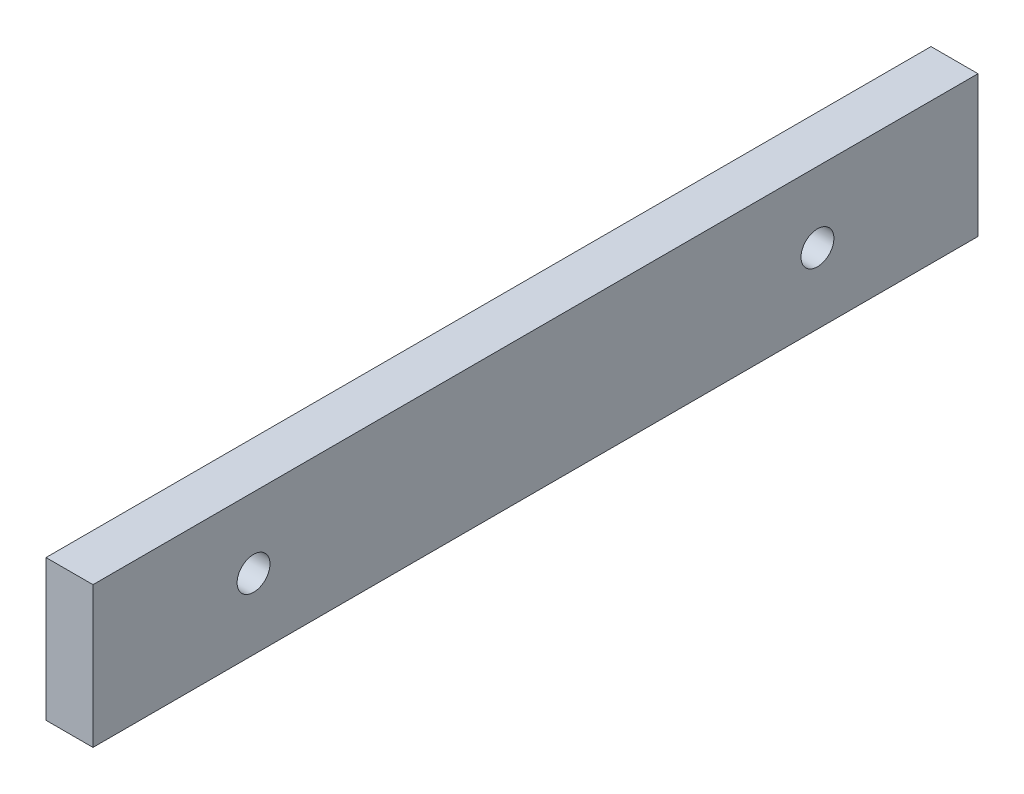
ISO-10303-21;
HEADER;
FILE_DESCRIPTION(('STEP AP214'),'2;1');
FILE_NAME('part.step','',(''),(''),'','','');
FILE_SCHEMA(('AUTOMOTIVE_DESIGN { 1 0 10303 214 1 1 1 1 }'));
ENDSEC;
DATA;
#1=APPLICATION_CONTEXT('core data for automotive mechanical design processes');
#2=APPLICATION_PROTOCOL_DEFINITION('international standard','automotive_design',2000,#1);
#3=PRODUCT_CONTEXT('',#1,'mechanical');
#4=PRODUCT('Part','Part','',(#3));
#5=PRODUCT_RELATED_PRODUCT_CATEGORY('part','',(#4));
#6=PRODUCT_DEFINITION_FORMATION('','',#4);
#7=PRODUCT_DEFINITION_CONTEXT('part definition',#1,'design');
#8=PRODUCT_DEFINITION('design','',#6,#7);
#9=PRODUCT_DEFINITION_SHAPE('','',#8);
#10=(LENGTH_UNIT() NAMED_UNIT(*) SI_UNIT(.MILLI.,.METRE.));
#11=(NAMED_UNIT(*) PLANE_ANGLE_UNIT() SI_UNIT($,.RADIAN.));
#12=(NAMED_UNIT(*) SI_UNIT($,.STERADIAN.) SOLID_ANGLE_UNIT());
#13=UNCERTAINTY_MEASURE_WITH_UNIT(LENGTH_MEASURE(1.E-05),#10,'distance_accuracy_value','');
#14=(GEOMETRIC_REPRESENTATION_CONTEXT(3) GLOBAL_UNCERTAINTY_ASSIGNED_CONTEXT((#13)) GLOBAL_UNIT_ASSIGNED_CONTEXT((#10,
#11,#12)) REPRESENTATION_CONTEXT('',''));
#15=CARTESIAN_POINT('',(0.,0.,0.));
#16=DIRECTION('',(0.,0.,1.));
#17=DIRECTION('',(1.,0.,0.));
#18=AXIS2_PLACEMENT_3D('',#15,#16,#17);
#19=CARTESIAN_POINT('',(0.,0.,56.5));
#20=DIRECTION('',(0.,1.,0.));
#21=DIRECTION('',(0.,0.,1.));
#22=AXIS2_PLACEMENT_3D('',#19,#20,#21);
#23=PLANE('',#22);
#24=DIRECTION('',(1.,0.,0.));
#25=VECTOR('',#24,1.);
#26=CARTESIAN_POINT('',(0.,0.,0.));
#27=LINE('',#26,#25);
#28=CARTESIAN_POINT('',(0.,0.,0.));
#29=VERTEX_POINT('',#28);
#30=CARTESIAN_POINT('',(3.,0.,0.));
#31=VERTEX_POINT('',#30);
#32=EDGE_CURVE('E102',#29,#31,#27,.T.);
#33=ORIENTED_EDGE('',*,*,#32,.T.);
#34=DIRECTION('',(0.,0.,-1.));
#35=VECTOR('',#34,1.);
#36=CARTESIAN_POINT('',(3.,0.,56.5));
#37=LINE('',#36,#35);
#38=CARTESIAN_POINT('',(3.,0.,56.5));
#39=VERTEX_POINT('',#38);
#40=EDGE_CURVE('E11',#39,#31,#37,.T.);
#41=ORIENTED_EDGE('',*,*,#40,.F.);
#42=DIRECTION('',(1.,0.,0.));
#43=VECTOR('',#42,1.);
#44=CARTESIAN_POINT('',(0.,0.,56.5));
#45=LINE('',#44,#43);
#46=CARTESIAN_POINT('',(0.,0.,56.5));
#47=VERTEX_POINT('',#46);
#48=EDGE_CURVE('E88',#47,#39,#45,.T.);
#49=ORIENTED_EDGE('',*,*,#48,.F.);
#50=DIRECTION('',(0.,0.,-1.));
#51=VECTOR('',#50,1.);
#52=CARTESIAN_POINT('',(0.,0.,56.5));
#53=LINE('',#52,#51);
#54=EDGE_CURVE('E55',#47,#29,#53,.T.);
#55=ORIENTED_EDGE('',*,*,#54,.T.);
#56=EDGE_LOOP('',(#33,#41,#49,#55));
#57=FACE_BOUND('',#56,.T.);
#58=ADVANCED_FACE('F39',(#57),#23,.F.);
#59=CARTESIAN_POINT('',(3.,0.,56.5));
#60=DIRECTION('',(-1.,0.,0.));
#61=DIRECTION('',(0.,-1.,0.));
#62=AXIS2_PLACEMENT_3D('',#59,#60,#61);
#63=PLANE('',#62);
#64=CARTESIAN_POINT('',(3.,4.5,10.25));
#65=DIRECTION('',(-1.,0.,0.));
#66=DIRECTION('',(0.,-1.,0.));
#67=AXIS2_PLACEMENT_3D('',#64,#65,#66);
#68=CIRCLE('',#67,1.05);
#69=CARTESIAN_POINT('',(3.,3.45,10.25));
#70=VERTEX_POINT('',#69);
#71=EDGE_CURVE('E104',#70,#70,#68,.T.);
#72=ORIENTED_EDGE('',*,*,#71,.T.);
#73=EDGE_LOOP('',(#72));
#74=FACE_BOUND('',#73,.T.);
#75=CARTESIAN_POINT('',(3.,4.5,46.25));
#76=DIRECTION('',(-1.,0.,0.));
#77=DIRECTION('',(0.,-1.,0.));
#78=AXIS2_PLACEMENT_3D('',#75,#76,#77);
#79=CIRCLE('',#78,1.05);
#80=CARTESIAN_POINT('',(3.,3.45,46.25));
#81=VERTEX_POINT('',#80);
#82=EDGE_CURVE('E114',#81,#81,#79,.T.);
#83=ORIENTED_EDGE('',*,*,#82,.T.);
#84=EDGE_LOOP('',(#83));
#85=FACE_BOUND('',#84,.T.);
#86=DIRECTION('',(0.,1.,0.));
#87=VECTOR('',#86,1.);
#88=CARTESIAN_POINT('',(3.,0.,0.));
#89=LINE('',#88,#87);
#90=CARTESIAN_POINT('',(3.,9.,0.));
#91=VERTEX_POINT('',#90);
#92=EDGE_CURVE('E93',#31,#91,#89,.T.);
#93=ORIENTED_EDGE('',*,*,#92,.T.);
#94=DIRECTION('',(0.,0.,-1.));
#95=VECTOR('',#94,1.);
#96=CARTESIAN_POINT('',(3.,9.,56.5));
#97=LINE('',#96,#95);
#98=CARTESIAN_POINT('',(3.,9.,56.5));
#99=VERTEX_POINT('',#98);
#100=EDGE_CURVE('E47',#99,#91,#97,.T.);
#101=ORIENTED_EDGE('',*,*,#100,.F.);
#102=DIRECTION('',(0.,1.,0.));
#103=VECTOR('',#102,1.);
#104=CARTESIAN_POINT('',(3.,0.,56.5));
#105=LINE('',#104,#103);
#106=EDGE_CURVE('E80',#39,#99,#105,.T.);
#107=ORIENTED_EDGE('',*,*,#106,.F.);
#108=ORIENTED_EDGE('',*,*,#40,.T.);
#109=EDGE_LOOP('',(#93,#101,#107,#108));
#110=FACE_BOUND('',#109,.T.);
#111=ADVANCED_FACE('F92',(#74,#85,#110),#63,.F.);
#112=CARTESIAN_POINT('',(0.,9.,56.5));
#113=DIRECTION('',(0.,1.,0.));
#114=DIRECTION('',(0.,0.,1.));
#115=AXIS2_PLACEMENT_3D('',#112,#113,#114);
#116=PLANE('',#115);
#117=DIRECTION('',(1.,0.,0.));
#118=VECTOR('',#117,1.);
#119=CARTESIAN_POINT('',(0.,9.,0.));
#120=LINE('',#119,#118);
#121=CARTESIAN_POINT('',(0.,9.,0.));
#122=VERTEX_POINT('',#121);
#123=EDGE_CURVE('E106',#122,#91,#120,.T.);
#124=ORIENTED_EDGE('',*,*,#123,.F.);
#125=DIRECTION('',(0.,0.,-1.));
#126=VECTOR('',#125,1.);
#127=CARTESIAN_POINT('',(0.,9.,56.5));
#128=LINE('',#127,#126);
#129=CARTESIAN_POINT('',(0.,9.,56.5));
#130=VERTEX_POINT('',#129);
#131=EDGE_CURVE('E69',#130,#122,#128,.T.);
#132=ORIENTED_EDGE('',*,*,#131,.F.);
#133=DIRECTION('',(1.,0.,0.));
#134=VECTOR('',#133,1.);
#135=CARTESIAN_POINT('',(0.,9.,56.5));
#136=LINE('',#135,#134);
#137=EDGE_CURVE('E87',#130,#99,#136,.T.);
#138=ORIENTED_EDGE('',*,*,#137,.T.);
#139=ORIENTED_EDGE('',*,*,#100,.T.);
#140=EDGE_LOOP('',(#124,#132,#138,#139));
#141=FACE_BOUND('',#140,.T.);
#142=ADVANCED_FACE('F96',(#141),#116,.T.);
#143=CARTESIAN_POINT('',(0.,0.,56.5));
#144=DIRECTION('',(-1.,0.,0.));
#145=DIRECTION('',(0.,-1.,0.));
#146=AXIS2_PLACEMENT_3D('',#143,#144,#145);
#147=PLANE('',#146);
#148=CARTESIAN_POINT('',(0.,4.5,10.25));
#149=DIRECTION('',(-1.,0.,0.));
#150=DIRECTION('',(0.,-1.,0.));
#151=AXIS2_PLACEMENT_3D('',#148,#149,#150);
#152=CIRCLE('',#151,1.05);
#153=CARTESIAN_POINT('',(0.,3.45,10.25));
#154=VERTEX_POINT('',#153);
#155=EDGE_CURVE('E120',#154,#154,#152,.T.);
#156=ORIENTED_EDGE('',*,*,#155,.F.);
#157=EDGE_LOOP('',(#156));
#158=FACE_BOUND('',#157,.T.);
#159=CARTESIAN_POINT('',(0.,4.5,46.25));
#160=DIRECTION('',(-1.,0.,0.));
#161=DIRECTION('',(0.,-1.,0.));
#162=AXIS2_PLACEMENT_3D('',#159,#160,#161);
#163=CIRCLE('',#162,1.05);
#164=CARTESIAN_POINT('',(0.,3.45,46.25));
#165=VERTEX_POINT('',#164);
#166=EDGE_CURVE('E117',#165,#165,#163,.T.);
#167=ORIENTED_EDGE('',*,*,#166,.F.);
#168=EDGE_LOOP('',(#167));
#169=FACE_BOUND('',#168,.T.);
#170=DIRECTION('',(0.,1.,0.));
#171=VECTOR('',#170,1.);
#172=CARTESIAN_POINT('',(0.,0.,0.));
#173=LINE('',#172,#171);
#174=EDGE_CURVE('E108',#29,#122,#173,.T.);
#175=ORIENTED_EDGE('',*,*,#174,.F.);
#176=ORIENTED_EDGE('',*,*,#54,.F.);
#177=DIRECTION('',(0.,1.,0.));
#178=VECTOR('',#177,1.);
#179=CARTESIAN_POINT('',(0.,0.,56.5));
#180=LINE('',#179,#178);
#181=EDGE_CURVE('E97',#47,#130,#180,.T.);
#182=ORIENTED_EDGE('',*,*,#181,.T.);
#183=ORIENTED_EDGE('',*,*,#131,.T.);
#184=EDGE_LOOP('',(#175,#176,#182,#183));
#185=FACE_BOUND('',#184,.T.);
#186=ADVANCED_FACE('F135',(#158,#169,#185),#147,.T.);
#187=CARTESIAN_POINT('',(0.,0.,56.5));
#188=DIRECTION('',(0.,0.,1.));
#189=DIRECTION('',(1.,0.,0.));
#190=AXIS2_PLACEMENT_3D('',#187,#188,#189);
#191=PLANE('',#190);
#192=ORIENTED_EDGE('',*,*,#48,.T.);
#193=ORIENTED_EDGE('',*,*,#106,.T.);
#194=ORIENTED_EDGE('',*,*,#137,.F.);
#195=ORIENTED_EDGE('',*,*,#181,.F.);
#196=EDGE_LOOP('',(#192,#193,#194,#195));
#197=FACE_BOUND('',#196,.T.);
#198=ADVANCED_FACE('F84',(#197),#191,.T.);
#199=CARTESIAN_POINT('',(0.,0.,0.));
#200=DIRECTION('',(0.,0.,1.));
#201=DIRECTION('',(1.,0.,0.));
#202=AXIS2_PLACEMENT_3D('',#199,#200,#201);
#203=PLANE('',#202);
#204=ORIENTED_EDGE('',*,*,#32,.F.);
#205=ORIENTED_EDGE('',*,*,#174,.T.);
#206=ORIENTED_EDGE('',*,*,#123,.T.);
#207=ORIENTED_EDGE('',*,*,#92,.F.);
#208=EDGE_LOOP('',(#204,#205,#206,#207));
#209=FACE_BOUND('',#208,.T.);
#210=ADVANCED_FACE('F142',(#209),#203,.F.);
#211=CARTESIAN_POINT('',(3.,4.5,46.25));
#212=DIRECTION('',(-1.,0.,0.));
#213=DIRECTION('',(0.,-1.,0.));
#214=AXIS2_PLACEMENT_3D('',#211,#212,#213);
#215=CYLINDRICAL_SURFACE('',#214,1.05);
#216=ORIENTED_EDGE('',*,*,#82,.F.);
#217=EDGE_LOOP('',(#216));
#218=FACE_BOUND('',#217,.T.);
#219=ORIENTED_EDGE('',*,*,#166,.T.);
#220=EDGE_LOOP('',(#219));
#221=FACE_BOUND('',#220,.T.);
#222=ADVANCED_FACE('F131',(#218,#221),#215,.F.);
#223=CARTESIAN_POINT('',(3.,4.5,10.25));
#224=DIRECTION('',(-1.,0.,0.));
#225=DIRECTION('',(0.,-1.,0.));
#226=AXIS2_PLACEMENT_3D('',#223,#224,#225);
#227=CYLINDRICAL_SURFACE('',#226,1.05);
#228=ORIENTED_EDGE('',*,*,#71,.F.);
#229=EDGE_LOOP('',(#228));
#230=FACE_BOUND('',#229,.T.);
#231=ORIENTED_EDGE('',*,*,#155,.T.);
#232=EDGE_LOOP('',(#231));
#233=FACE_BOUND('',#232,.T.);
#234=ADVANCED_FACE('F128',(#230,#233),#227,.F.);
#235=CLOSED_SHELL('',(#58,#111,#142,#186,#198,#210,#222,#234));
#236=MANIFOLD_SOLID_BREP('B2',#235);
#237=ADVANCED_BREP_SHAPE_REPRESENTATION('',(#18,#236),#14);
#238=SHAPE_DEFINITION_REPRESENTATION(#9,#237);
ENDSEC;
END-ISO-10303-21;
